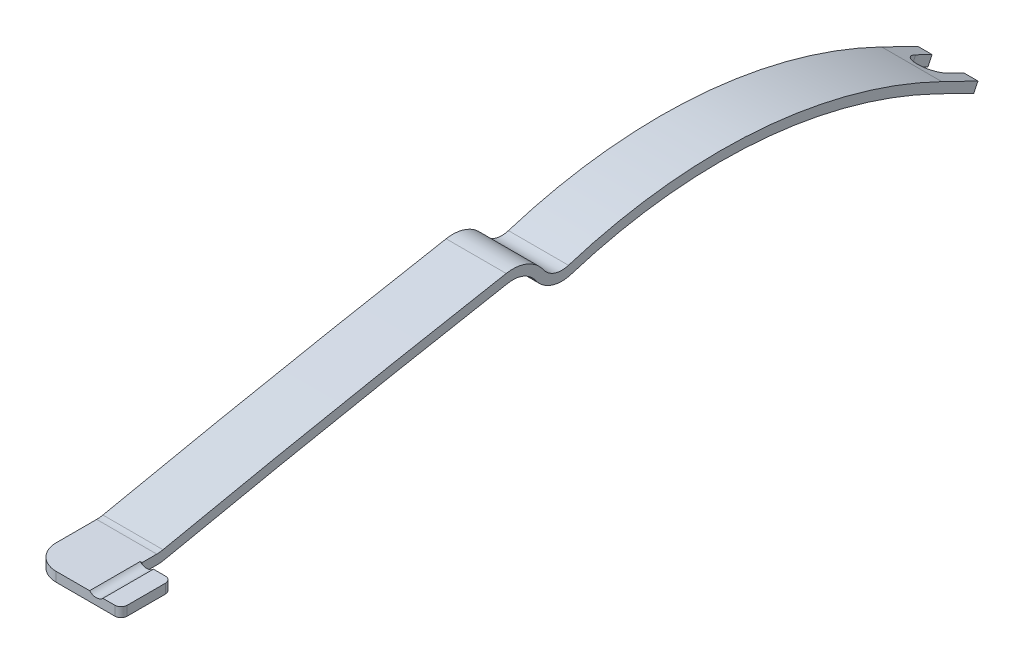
ISO-10303-21;
HEADER;
FILE_DESCRIPTION(('STEP AP214'),'2;1');
FILE_NAME('part.step','',(''),(''),'','','');
FILE_SCHEMA(('AUTOMOTIVE_DESIGN { 1 0 10303 214 1 1 1 1 }'));
ENDSEC;
DATA;
#1=APPLICATION_CONTEXT('core data for automotive mechanical design processes');
#2=APPLICATION_PROTOCOL_DEFINITION('international standard','automotive_design',2000,#1);
#3=PRODUCT_CONTEXT('',#1,'mechanical');
#4=PRODUCT('Part','Part','',(#3));
#5=PRODUCT_RELATED_PRODUCT_CATEGORY('part','',(#4));
#6=PRODUCT_DEFINITION_FORMATION('','',#4);
#7=PRODUCT_DEFINITION_CONTEXT('part definition',#1,'design');
#8=PRODUCT_DEFINITION('design','',#6,#7);
#9=PRODUCT_DEFINITION_SHAPE('','',#8);
#10=(LENGTH_UNIT() NAMED_UNIT(*) SI_UNIT(.MILLI.,.METRE.));
#11=(NAMED_UNIT(*) PLANE_ANGLE_UNIT() SI_UNIT($,.RADIAN.));
#12=(NAMED_UNIT(*) SI_UNIT($,.STERADIAN.) SOLID_ANGLE_UNIT());
#13=UNCERTAINTY_MEASURE_WITH_UNIT(LENGTH_MEASURE(1.E-05),#10,'distance_accuracy_value','');
#14=(GEOMETRIC_REPRESENTATION_CONTEXT(3) GLOBAL_UNCERTAINTY_ASSIGNED_CONTEXT((#13)) GLOBAL_UNIT_ASSIGNED_CONTEXT((#10,
#11,#12)) REPRESENTATION_CONTEXT('',''));
#15=CARTESIAN_POINT('',(0.,0.,0.));
#16=DIRECTION('',(0.,0.,1.));
#17=DIRECTION('',(1.,0.,0.));
#18=AXIS2_PLACEMENT_3D('',#15,#16,#17);
#19=CARTESIAN_POINT('',(7.6962,1.21412,53.34));
#20=DIRECTION('',(0.,-1.,0.));
#21=DIRECTION('',(0.,0.,-1.));
#22=AXIS2_PLACEMENT_3D('',#19,#20,#21);
#23=PLANE('',#22);
#24=DIRECTION('',(-1.,0.,0.));
#25=VECTOR('',#24,1.);
#26=CARTESIAN_POINT('',(7.6962,1.21412,46.863));
#27=LINE('',#26,#25);
#28=CARTESIAN_POINT('',(10.68705,1.21412,46.863));
#29=VERTEX_POINT('',#28);
#30=CARTESIAN_POINT('',(9.15451734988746,1.21412,46.863));
#31=VERTEX_POINT('',#30);
#32=EDGE_CURVE('E380',#29,#31,#27,.T.);
#33=ORIENTED_EDGE('',*,*,#32,.T.);
#34=DIRECTION('',(0.,0.,-1.));
#35=VECTOR('',#34,1.);
#36=CARTESIAN_POINT('',(9.15451734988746,1.21412,56.7075960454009));
#37=LINE('',#36,#35);
#38=CARTESIAN_POINT('',(9.15451734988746,1.21412,53.34));
#39=VERTEX_POINT('',#38);
#40=EDGE_CURVE('E52',#31,#39,#37,.F.);
#41=ORIENTED_EDGE('',*,*,#40,.T.);
#42=DIRECTION('',(-1.,0.,0.));
#43=VECTOR('',#42,1.);
#44=CARTESIAN_POINT('',(7.6962,1.21412,53.34));
#45=LINE('',#44,#43);
#46=CARTESIAN_POINT('',(10.68705,1.21412,53.34));
#47=VERTEX_POINT('',#46);
#48=EDGE_CURVE('E236',#47,#39,#45,.T.);
#49=ORIENTED_EDGE('',*,*,#48,.F.);
#50=CARTESIAN_POINT('',(10.68705,1.21412,52.54625));
#51=DIRECTION('',(0.,1.,0.));
#52=DIRECTION('',(0.,0.,1.));
#53=AXIS2_PLACEMENT_3D('',#50,#51,#52);
#54=CIRCLE('',#53,0.793750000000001);
#55=CARTESIAN_POINT('',(11.4808,1.21412,52.54625));
#56=VERTEX_POINT('',#55);
#57=EDGE_CURVE('E504',#47,#56,#54,.T.);
#58=ORIENTED_EDGE('',*,*,#57,.T.);
#59=DIRECTION('',(0.,0.,-1.));
#60=VECTOR('',#59,1.);
#61=CARTESIAN_POINT('',(11.4808,1.21412,52.54625));
#62=LINE('',#61,#60);
#63=CARTESIAN_POINT('',(11.4808,1.21412,47.65675));
#64=VERTEX_POINT('',#63);
#65=EDGE_CURVE('E506',#56,#64,#62,.T.);
#66=ORIENTED_EDGE('',*,*,#65,.T.);
#67=CARTESIAN_POINT('',(10.68705,1.21412,47.65675));
#68=DIRECTION('',(0.,1.,0.));
#69=DIRECTION('',(0.,0.,-1.));
#70=AXIS2_PLACEMENT_3D('',#67,#68,#69);
#71=CIRCLE('',#70,0.793750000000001);
#72=EDGE_CURVE('E383',#64,#29,#71,.T.);
#73=ORIENTED_EDGE('',*,*,#72,.T.);
#74=EDGE_LOOP('',(#33,#41,#49,#58,#66,#73));
#75=FACE_BOUND('',#74,.T.);
#76=ADVANCED_FACE('F35',(#75),#23,.F.);
#77=CARTESIAN_POINT('',(7.6962,0.,-59.69));
#78=DIRECTION('',(0.,0.437146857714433,0.899390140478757));
#79=DIRECTION('',(0.,-0.899390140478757,0.437146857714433));
#80=AXIS2_PLACEMENT_3D('',#77,#78,#79);
#81=PLANE('',#80);
#82=DIRECTION('',(-1.,0.,0.));
#83=VECTOR('',#82,1.);
#84=CARTESIAN_POINT('',(7.6962,1.0919675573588,-60.2207487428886));
#85=LINE('',#84,#83);
#86=CARTESIAN_POINT('',(1.8161,1.0919675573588,-60.2207487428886));
#87=VERTEX_POINT('',#86);
#88=CARTESIAN_POINT('',(0.,1.0919675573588,-60.2207487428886));
#89=VERTEX_POINT('',#88);
#90=EDGE_CURVE('E269',#87,#89,#85,.T.);
#91=ORIENTED_EDGE('',*,*,#90,.F.);
#92=DIRECTION('',(0.,0.899390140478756,-0.437146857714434));
#93=VECTOR('',#92,1.);
#94=CARTESIAN_POINT('',(1.8161,-44.4395048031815,-38.0902636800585));
#95=LINE('',#94,#93);
#96=CARTESIAN_POINT('',(1.8161,0.,-59.69));
#97=VERTEX_POINT('',#96);
#98=EDGE_CURVE('E409',#97,#87,#95,.T.);
#99=ORIENTED_EDGE('',*,*,#98,.F.);
#100=DIRECTION('',(-1.,0.,0.));
#101=VECTOR('',#100,1.);
#102=CARTESIAN_POINT('',(7.6962,0.,-59.69));
#103=LINE('',#102,#101);
#104=CARTESIAN_POINT('',(0.,0.,-59.69));
#105=VERTEX_POINT('',#104);
#106=EDGE_CURVE('E273',#97,#105,#103,.T.);
#107=ORIENTED_EDGE('',*,*,#106,.T.);
#108=DIRECTION('',(0.,0.899390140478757,-0.437146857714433));
#109=VECTOR('',#108,1.);
#110=CARTESIAN_POINT('',(0.,0.,-59.69));
#111=LINE('',#110,#109);
#112=EDGE_CURVE('E349',#105,#89,#111,.T.);
#113=ORIENTED_EDGE('',*,*,#112,.T.);
#114=EDGE_LOOP('',(#91,#99,#107,#113));
#115=FACE_BOUND('',#114,.T.);
#116=ADVANCED_FACE('F461',(#115),#81,.F.);
#117=CARTESIAN_POINT('',(7.6962,0.,53.34));
#118=DIRECTION('',(0.,0.,-1.));
#119=DIRECTION('',(-1.,0.,0.));
#120=AXIS2_PLACEMENT_3D('',#117,#118,#119);
#121=PLANE('',#120);
#122=ORIENTED_EDGE('',*,*,#48,.T.);
#123=CARTESIAN_POINT('',(8.3058,2.049145,53.34));
#124=DIRECTION('',(0.,0.,-1.));
#125=DIRECTION('',(-1.,0.,0.));
#126=AXIS2_PLACEMENT_3D('',#123,#124,#125);
#127=CIRCLE('',#126,1.190625);
#128=CARTESIAN_POINT('',(7.45708265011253,1.21412,53.34));
#129=VERTEX_POINT('',#128);
#130=EDGE_CURVE('E223',#129,#39,#127,.F.);
#131=ORIENTED_EDGE('',*,*,#130,.F.);
#132=CARTESIAN_POINT('',(3.175,1.21412,53.34));
#133=VERTEX_POINT('',#132);
#134=EDGE_CURVE('E234',#129,#133,#45,.T.);
#135=ORIENTED_EDGE('',*,*,#134,.T.);
#136=DIRECTION('',(0.,-1.,0.));
#137=VECTOR('',#136,1.);
#138=CARTESIAN_POINT('',(3.175,0.,53.34));
#139=LINE('',#138,#137);
#140=CARTESIAN_POINT('',(3.175,0.,53.34));
#141=VERTEX_POINT('',#140);
#142=EDGE_CURVE('E298',#133,#141,#139,.T.);
#143=ORIENTED_EDGE('',*,*,#142,.T.);
#144=DIRECTION('',(-1.,0.,0.));
#145=VECTOR('',#144,1.);
#146=CARTESIAN_POINT('',(7.6962,0.,53.34));
#147=LINE('',#146,#145);
#148=CARTESIAN_POINT('',(10.68705,0.,53.34));
#149=VERTEX_POINT('',#148);
#150=EDGE_CURVE('E295',#149,#141,#147,.T.);
#151=ORIENTED_EDGE('',*,*,#150,.F.);
#152=DIRECTION('',(0.,1.,0.));
#153=VECTOR('',#152,1.);
#154=CARTESIAN_POINT('',(10.68705,-7.50164822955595,53.34));
#155=LINE('',#154,#153);
#156=EDGE_CURVE('E382',#149,#47,#155,.T.);
#157=ORIENTED_EDGE('',*,*,#156,.T.);
#158=EDGE_LOOP('',(#122,#131,#135,#143,#151,#157));
#159=FACE_BOUND('',#158,.T.);
#160=ADVANCED_FACE('F232',(#159),#121,.F.);
#161=CARTESIAN_POINT('',(7.6962,0.,53.34));
#162=DIRECTION('',(0.,1.,0.));
#163=DIRECTION('',(0.,0.,1.));
#164=AXIS2_PLACEMENT_3D('',#161,#162,#163);
#165=PLANE('',#164);
#166=ORIENTED_EDGE('',*,*,#150,.T.);
#167=CARTESIAN_POINT('',(3.175,0.,50.165));
#168=DIRECTION('',(0.,1.,0.));
#169=DIRECTION('',(0.,0.,1.));
#170=AXIS2_PLACEMENT_3D('',#167,#168,#169);
#171=CIRCLE('',#170,3.175);
#172=CARTESIAN_POINT('',(0.,0.,50.165));
#173=VERTEX_POINT('',#172);
#174=EDGE_CURVE('E367',#141,#173,#171,.F.);
#175=ORIENTED_EDGE('',*,*,#174,.T.);
#176=DIRECTION('',(0.,0.,-1.));
#177=VECTOR('',#176,1.);
#178=CARTESIAN_POINT('',(0.,0.,53.34));
#179=LINE('',#178,#177);
#180=CARTESIAN_POINT('',(0.,0.,44.984535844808));
#181=VERTEX_POINT('',#180);
#182=EDGE_CURVE('E334',#173,#181,#179,.T.);
#183=ORIENTED_EDGE('',*,*,#182,.T.);
#184=DIRECTION('',(-1.,0.,0.));
#185=VECTOR('',#184,1.);
#186=CARTESIAN_POINT('',(7.6962,0.,44.984535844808));
#187=LINE('',#186,#185);
#188=CARTESIAN_POINT('',(7.6962,0.,44.984535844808));
#189=VERTEX_POINT('',#188);
#190=EDGE_CURVE('E292',#189,#181,#187,.T.);
#191=ORIENTED_EDGE('',*,*,#190,.F.);
#192=DIRECTION('',(0.,0.,-1.));
#193=VECTOR('',#192,1.);
#194=CARTESIAN_POINT('',(7.6962,0.,53.34));
#195=LINE('',#194,#193);
#196=CARTESIAN_POINT('',(7.6962,0.,46.863));
#197=VERTEX_POINT('',#196);
#198=EDGE_CURVE('E299',#197,#189,#195,.T.);
#199=ORIENTED_EDGE('',*,*,#198,.F.);
#200=DIRECTION('',(1.,0.,0.));
#201=VECTOR('',#200,1.);
#202=CARTESIAN_POINT('',(7.6962,0.,46.863));
#203=LINE('',#202,#201);
#204=CARTESIAN_POINT('',(10.68705,0.,46.863));
#205=VERTEX_POINT('',#204);
#206=EDGE_CURVE('E374',#197,#205,#203,.T.);
#207=ORIENTED_EDGE('',*,*,#206,.T.);
#208=CARTESIAN_POINT('',(10.68705,0.,47.65675));
#209=DIRECTION('',(0.,1.,0.));
#210=DIRECTION('',(0.,0.,1.));
#211=AXIS2_PLACEMENT_3D('',#208,#209,#210);
#212=CIRCLE('',#211,0.793750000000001);
#213=CARTESIAN_POINT('',(11.4808,0.,47.65675));
#214=VERTEX_POINT('',#213);
#215=EDGE_CURVE('E377',#205,#214,#212,.F.);
#216=ORIENTED_EDGE('',*,*,#215,.T.);
#217=DIRECTION('',(0.,0.,1.));
#218=VECTOR('',#217,1.);
#219=CARTESIAN_POINT('',(11.4808,0.,52.54625));
#220=LINE('',#219,#218);
#221=CARTESIAN_POINT('',(11.4808,0.,52.54625));
#222=VERTEX_POINT('',#221);
#223=EDGE_CURVE('E499',#214,#222,#220,.T.);
#224=ORIENTED_EDGE('',*,*,#223,.T.);
#225=CARTESIAN_POINT('',(10.68705,0.,52.54625));
#226=DIRECTION('',(0.,1.,0.));
#227=DIRECTION('',(0.,0.,1.));
#228=AXIS2_PLACEMENT_3D('',#225,#226,#227);
#229=CIRCLE('',#228,0.793750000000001);
#230=EDGE_CURVE('E386',#222,#149,#229,.F.);
#231=ORIENTED_EDGE('',*,*,#230,.T.);
#232=EDGE_LOOP('',(#166,#175,#183,#191,#199,#207,#216,#224,#231));
#233=FACE_BOUND('',#232,.T.);
#234=ADVANCED_FACE('F491',(#233),#165,.F.);
#235=CARTESIAN_POINT('',(7.6962,5.07999999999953,44.984535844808));
#236=DIRECTION('',(-1.,0.,0.));
#237=DIRECTION('',(0.,0.,1.));
#238=AXIS2_PLACEMENT_3D('',#235,#236,#237);
#239=CYLINDRICAL_SURFACE('',#238,5.0799999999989);
#240=CARTESIAN_POINT('',(0.,5.07999999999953,44.984535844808));
#241=DIRECTION('',(1.,0.,0.));
#242=DIRECTION('',(0.,0.,-1.));
#243=AXIS2_PLACEMENT_3D('',#240,#241,#242);
#244=CIRCLE('',#243,5.0799999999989);
#245=CARTESIAN_POINT('',(0.,0.111072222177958,43.9280526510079));
#246=VERTEX_POINT('',#245);
#247=EDGE_CURVE('E336',#181,#246,#244,.T.);
#248=ORIENTED_EDGE('',*,*,#247,.T.);
#249=DIRECTION('',(-1.,0.,0.));
#250=VECTOR('',#249,1.);
#251=CARTESIAN_POINT('',(7.6962,0.111072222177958,43.9280526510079));
#252=LINE('',#251,#250);
#253=CARTESIAN_POINT('',(7.6962,0.111072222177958,43.9280526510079));
#254=VERTEX_POINT('',#253);
#255=EDGE_CURVE('E289',#254,#246,#252,.T.);
#256=ORIENTED_EDGE('',*,*,#255,.F.);
#257=CARTESIAN_POINT('',(7.6962,5.07999999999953,44.984535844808));
#258=DIRECTION('',(1.,0.,0.));
#259=DIRECTION('',(0.,0.,-1.));
#260=AXIS2_PLACEMENT_3D('',#257,#258,#259);
#261=CIRCLE('',#260,5.0799999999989);
#262=EDGE_CURVE('E301',#189,#254,#261,.T.);
#263=ORIENTED_EDGE('',*,*,#262,.F.);
#264=ORIENTED_EDGE('',*,*,#190,.T.);
#265=EDGE_LOOP('',(#248,#256,#263,#264));
#266=FACE_BOUND('',#265,.T.);
#267=ADVANCED_FACE('F576',(#266),#239,.T.);
#268=CARTESIAN_POINT('',(7.6962,-1470.00667961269,-268.645356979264));
#269=DIRECTION('',(-1.,0.,0.));
#270=DIRECTION('',(0.,0.,1.));
#271=AXIS2_PLACEMENT_3D('',#268,#269,#270);
#272=CYLINDRICAL_SURFACE('',#271,1502.979820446);
#273=CARTESIAN_POINT('',(0.,-1470.00667961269,-268.645356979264));
#274=DIRECTION('',(-1.,0.,0.));
#275=DIRECTION('',(0.,0.,1.));
#276=AXIS2_PLACEMENT_3D('',#273,#274,#275);
#277=CIRCLE('',#276,1502.979820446);
#278=CARTESIAN_POINT('',(0.,8.7691698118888,0.));
#279=VERTEX_POINT('',#278);
#280=EDGE_CURVE('E338',#246,#279,#277,.T.);
#281=ORIENTED_EDGE('',*,*,#280,.T.);
#282=DIRECTION('',(-1.,0.,0.));
#283=VECTOR('',#282,1.);
#284=CARTESIAN_POINT('',(7.6962,8.7691698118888,0.));
#285=LINE('',#284,#283);
#286=CARTESIAN_POINT('',(7.6962,8.7691698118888,0.));
#287=VERTEX_POINT('',#286);
#288=EDGE_CURVE('E286',#287,#279,#285,.T.);
#289=ORIENTED_EDGE('',*,*,#288,.F.);
#290=CARTESIAN_POINT('',(7.6962,-1470.00667961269,-268.645356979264));
#291=DIRECTION('',(-1.,0.,0.));
#292=DIRECTION('',(0.,0.,1.));
#293=AXIS2_PLACEMENT_3D('',#290,#291,#292);
#294=CIRCLE('',#293,1502.979820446);
#295=EDGE_CURVE('E310',#254,#287,#294,.T.);
#296=ORIENTED_EDGE('',*,*,#295,.F.);
#297=ORIENTED_EDGE('',*,*,#255,.T.);
#298=EDGE_LOOP('',(#281,#289,#296,#297));
#299=FACE_BOUND('',#298,.T.);
#300=ADVANCED_FACE('F572',(#299),#272,.F.);
#301=CARTESIAN_POINT('',(7.6962,5.27043559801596,-0.635605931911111));
#302=DIRECTION('',(-1.,0.,0.));
#303=DIRECTION('',(0.,0.,1.));
#304=AXIS2_PLACEMENT_3D('',#301,#302,#303);
#305=CYLINDRICAL_SURFACE('',#304,3.556);
#306=CARTESIAN_POINT('',(0.,5.27043559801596,-0.635605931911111));
#307=DIRECTION('',(-1.,0.,0.));
#308=DIRECTION('',(0.,0.,1.));
#309=AXIS2_PLACEMENT_3D('',#306,#307,#308);
#310=CIRCLE('',#309,3.556);
#311=CARTESIAN_POINT('',(0.,7.2898,-3.56260156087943));
#312=VERTEX_POINT('',#311);
#313=EDGE_CURVE('E340',#279,#312,#310,.T.);
#314=ORIENTED_EDGE('',*,*,#313,.T.);
#315=DIRECTION('',(-1.,0.,0.));
#316=VECTOR('',#315,1.);
#317=CARTESIAN_POINT('',(7.6962,7.2898,-3.56260156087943));
#318=LINE('',#317,#316);
#319=CARTESIAN_POINT('',(7.6962,7.2898,-3.56260156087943));
#320=VERTEX_POINT('',#319);
#321=EDGE_CURVE('E283',#320,#312,#318,.T.);
#322=ORIENTED_EDGE('',*,*,#321,.F.);
#323=CARTESIAN_POINT('',(7.6962,5.27043559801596,-0.635605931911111));
#324=DIRECTION('',(-1.,0.,0.));
#325=DIRECTION('',(0.,0.,1.));
#326=AXIS2_PLACEMENT_3D('',#323,#324,#325);
#327=CIRCLE('',#326,3.556);
#328=EDGE_CURVE('E312',#287,#320,#327,.T.);
#329=ORIENTED_EDGE('',*,*,#328,.F.);
#330=ORIENTED_EDGE('',*,*,#288,.T.);
#331=EDGE_LOOP('',(#314,#322,#329,#330));
#332=FACE_BOUND('',#331,.T.);
#333=ADVANCED_FACE('F568',(#332),#305,.F.);
#334=CARTESIAN_POINT('',(7.6962,9.5976450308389,-6.9077394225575));
#335=DIRECTION('',(-1.,0.,0.));
#336=DIRECTION('',(0.,0.,1.));
#337=AXIS2_PLACEMENT_3D('',#334,#335,#336);
#338=CYLINDRICAL_SURFACE('',#337,4.06400000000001);
#339=CARTESIAN_POINT('',(0.,9.5976450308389,-6.9077394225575));
#340=DIRECTION('',(1.,0.,0.));
#341=DIRECTION('',(0.,0.,-1.));
#342=AXIS2_PLACEMENT_3D('',#339,#340,#341);
#343=CIRCLE('',#342,4.06400000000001);
#344=CARTESIAN_POINT('',(0.,5.72116981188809,-8.128));
#345=VERTEX_POINT('',#344);
#346=EDGE_CURVE('E342',#312,#345,#343,.T.);
#347=ORIENTED_EDGE('',*,*,#346,.T.);
#348=DIRECTION('',(-1.,0.,0.));
#349=VECTOR('',#348,1.);
#350=CARTESIAN_POINT('',(7.6962,5.72116981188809,-8.128));
#351=LINE('',#350,#349);
#352=CARTESIAN_POINT('',(7.6962,5.72116981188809,-8.128));
#353=VERTEX_POINT('',#352);
#354=EDGE_CURVE('E280',#353,#345,#351,.T.);
#355=ORIENTED_EDGE('',*,*,#354,.F.);
#356=CARTESIAN_POINT('',(7.6962,9.5976450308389,-6.9077394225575));
#357=DIRECTION('',(1.,0.,0.));
#358=DIRECTION('',(0.,0.,-1.));
#359=AXIS2_PLACEMENT_3D('',#356,#357,#358);
#360=CIRCLE('',#359,4.06400000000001);
#361=EDGE_CURVE('E314',#320,#353,#360,.T.);
#362=ORIENTED_EDGE('',*,*,#361,.F.);
#363=ORIENTED_EDGE('',*,*,#321,.T.);
#364=EDGE_LOOP('',(#347,#355,#362,#363));
#365=FACE_BOUND('',#364,.T.);
#366=ADVANCED_FACE('F565',(#365),#338,.T.);
#367=CARTESIAN_POINT('',(7.6962,-54.9733376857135,-27.2337882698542));
#368=DIRECTION('',(-1.,0.,0.));
#369=DIRECTION('',(0.,0.,1.));
#370=AXIS2_PLACEMENT_3D('',#367,#368,#369);
#371=CYLINDRICAL_SURFACE('',#370,63.6306088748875);
#372=CARTESIAN_POINT('',(0.,-54.9733376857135,-27.2337882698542));
#373=DIRECTION('',(-1.,0.,0.));
#374=DIRECTION('',(0.,0.,1.));
#375=AXIS2_PLACEMENT_3D('',#372,#373,#374);
#376=CIRCLE('',#375,63.6306088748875);
#377=CARTESIAN_POINT('',(0.,2.2554045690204,-55.0497089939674));
#378=VERTEX_POINT('',#377);
#379=EDGE_CURVE('E344',#345,#378,#376,.T.);
#380=ORIENTED_EDGE('',*,*,#379,.T.);
#381=DIRECTION('',(-1.,0.,0.));
#382=VECTOR('',#381,1.);
#383=CARTESIAN_POINT('',(7.6962,2.2554045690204,-55.0497089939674));
#384=LINE('',#383,#382);
#385=CARTESIAN_POINT('',(7.6962,2.2554045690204,-55.0497089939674));
#386=VERTEX_POINT('',#385);
#387=EDGE_CURVE('E277',#386,#378,#384,.T.);
#388=ORIENTED_EDGE('',*,*,#387,.F.);
#389=CARTESIAN_POINT('',(7.6962,-54.9733376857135,-27.2337882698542));
#390=DIRECTION('',(-1.,0.,0.));
#391=DIRECTION('',(0.,0.,1.));
#392=AXIS2_PLACEMENT_3D('',#389,#390,#391);
#393=CIRCLE('',#392,63.6306088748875);
#394=EDGE_CURVE('E316',#353,#386,#393,.T.);
#395=ORIENTED_EDGE('',*,*,#394,.F.);
#396=ORIENTED_EDGE('',*,*,#354,.T.);
#397=EDGE_LOOP('',(#380,#388,#395,#396));
#398=FACE_BOUND('',#397,.T.);
#399=ADVANCED_FACE('F562',(#398),#371,.F.);
#400=CARTESIAN_POINT('',(7.6962,2.25540456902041,-55.0497089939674));
#401=DIRECTION('',(0.,0.899390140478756,-0.437146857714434));
#402=DIRECTION('',(0.,0.437146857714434,0.899390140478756));
#403=AXIS2_PLACEMENT_3D('',#400,#401,#402);
#404=PLANE('',#403);
#405=ORIENTED_EDGE('',*,*,#106,.F.);
#406=DIRECTION('',(0.,0.437146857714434,0.899390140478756));
#407=VECTOR('',#406,1.);
#408=CARTESIAN_POINT('',(1.8161,2.25540456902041,-55.0497089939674));
#409=LINE('',#408,#407);
#410=CARTESIAN_POINT('',(1.8161,1.02013683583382,-57.5911606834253));
#411=VERTEX_POINT('',#410);
#412=EDGE_CURVE('E417',#97,#411,#409,.T.);
#413=ORIENTED_EDGE('',*,*,#412,.T.);
#414=CARTESIAN_POINT('',(3.8481,1.02013683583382,-57.5911606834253));
#415=DIRECTION('',(0.,0.899390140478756,-0.437146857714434));
#416=DIRECTION('',(0.,0.437146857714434,0.899390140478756));
#417=AXIS2_PLACEMENT_3D('',#414,#415,#416);
#418=CIRCLE('',#417,2.032);
#419=CARTESIAN_POINT('',(5.8801,1.02013683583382,-57.5911606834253));
#420=VERTEX_POINT('',#419);
#421=EDGE_CURVE('E307',#411,#420,#418,.T.);
#422=ORIENTED_EDGE('',*,*,#421,.T.);
#423=DIRECTION('',(0.,-0.437146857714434,-0.899390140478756));
#424=VECTOR('',#423,1.);
#425=CARTESIAN_POINT('',(5.8801,2.25540456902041,-55.0497089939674));
#426=LINE('',#425,#424);
#427=CARTESIAN_POINT('',(5.8801,0.,-59.69));
#428=VERTEX_POINT('',#427);
#429=EDGE_CURVE('E408',#420,#428,#426,.T.);
#430=ORIENTED_EDGE('',*,*,#429,.T.);
#431=CARTESIAN_POINT('',(7.6962,0.,-59.69));
#432=VERTEX_POINT('',#431);
#433=EDGE_CURVE('E274',#432,#428,#103,.T.);
#434=ORIENTED_EDGE('',*,*,#433,.F.);
#435=DIRECTION('',(0.,-0.437146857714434,-0.899390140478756));
#436=VECTOR('',#435,1.);
#437=CARTESIAN_POINT('',(7.6962,2.25540456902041,-55.0497089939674));
#438=LINE('',#437,#436);
#439=EDGE_CURVE('E318',#386,#432,#438,.T.);
#440=ORIENTED_EDGE('',*,*,#439,.F.);
#441=ORIENTED_EDGE('',*,*,#387,.T.);
#442=DIRECTION('',(0.,-0.437146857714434,-0.899390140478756));
#443=VECTOR('',#442,1.);
#444=CARTESIAN_POINT('',(0.,2.25540456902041,-55.0497089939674));
#445=LINE('',#444,#443);
#446=EDGE_CURVE('E346',#378,#105,#445,.T.);
#447=ORIENTED_EDGE('',*,*,#446,.T.);
#448=EDGE_LOOP('',(#405,#413,#422,#430,#434,#440,#441,#447));
#449=FACE_BOUND('',#448,.T.);
#450=ADVANCED_FACE('F422',(#449),#404,.F.);
#451=ORIENTED_EDGE('',*,*,#433,.T.);
#452=DIRECTION('',(0.,0.899390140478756,-0.437146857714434));
#453=VECTOR('',#452,1.);
#454=CARTESIAN_POINT('',(5.8801,-44.4395048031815,-38.0902636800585));
#455=LINE('',#454,#453);
#456=CARTESIAN_POINT('',(5.8801,1.0919675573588,-60.2207487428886));
#457=VERTEX_POINT('',#456);
#458=EDGE_CURVE('E411',#428,#457,#455,.T.);
#459=ORIENTED_EDGE('',*,*,#458,.T.);
#460=CARTESIAN_POINT('',(7.6962,1.0919675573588,-60.2207487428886));
#461=VERTEX_POINT('',#460);
#462=EDGE_CURVE('E270',#461,#457,#85,.T.);
#463=ORIENTED_EDGE('',*,*,#462,.F.);
#464=DIRECTION('',(0.,0.899390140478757,-0.437146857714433));
#465=VECTOR('',#464,1.);
#466=CARTESIAN_POINT('',(7.6962,0.,-59.69));
#467=LINE('',#466,#465);
#468=EDGE_CURVE('E320',#432,#461,#467,.T.);
#469=ORIENTED_EDGE('',*,*,#468,.F.);
#470=EDGE_LOOP('',(#451,#459,#463,#469));
#471=FACE_BOUND('',#470,.T.);
#472=ADVANCED_FACE('F441',(#471),#81,.F.);
#473=CARTESIAN_POINT('',(7.6962,1.0919675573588,-60.2207487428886));
#474=DIRECTION('',(0.,-0.899390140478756,0.437146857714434));
#475=DIRECTION('',(0.,-0.437146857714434,-0.899390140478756));
#476=AXIS2_PLACEMENT_3D('',#473,#474,#475);
#477=PLANE('',#476);
#478=CARTESIAN_POINT('',(3.8481,2.11210439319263,-58.1219094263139));
#479=DIRECTION('',(0.,0.899390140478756,-0.437146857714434));
#480=DIRECTION('',(0.,-0.437146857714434,-0.899390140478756));
#481=AXIS2_PLACEMENT_3D('',#478,#479,#480);
#482=CIRCLE('',#481,2.032);
#483=CARTESIAN_POINT('',(1.8161,2.11210439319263,-58.1219094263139));
#484=VERTEX_POINT('',#483);
#485=CARTESIAN_POINT('',(5.8801,2.11210439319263,-58.1219094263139));
#486=VERTEX_POINT('',#485);
#487=EDGE_CURVE('E376',#484,#486,#482,.T.);
#488=ORIENTED_EDGE('',*,*,#487,.F.);
#489=DIRECTION('',(0.,0.437146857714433,0.899390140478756));
#490=VECTOR('',#489,1.);
#491=CARTESIAN_POINT('',(1.8161,2.11210439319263,-58.1219094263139));
#492=LINE('',#491,#490);
#493=EDGE_CURVE('E402',#87,#484,#492,.T.);
#494=ORIENTED_EDGE('',*,*,#493,.F.);
#495=ORIENTED_EDGE('',*,*,#90,.T.);
#496=DIRECTION('',(0.,0.437146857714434,0.899390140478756));
#497=VECTOR('',#496,1.);
#498=CARTESIAN_POINT('',(0.,1.0919675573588,-60.2207487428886));
#499=LINE('',#498,#497);
#500=CARTESIAN_POINT('',(0.,3.34737212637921,-55.580457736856));
#501=VERTEX_POINT('',#500);
#502=EDGE_CURVE('E352',#89,#501,#499,.T.);
#503=ORIENTED_EDGE('',*,*,#502,.T.);
#504=DIRECTION('',(-1.,0.,0.));
#505=VECTOR('',#504,1.);
#506=CARTESIAN_POINT('',(7.6962,3.34737212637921,-55.580457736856));
#507=LINE('',#506,#505);
#508=CARTESIAN_POINT('',(7.6962,3.34737212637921,-55.580457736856));
#509=VERTEX_POINT('',#508);
#510=EDGE_CURVE('E266',#509,#501,#507,.T.);
#511=ORIENTED_EDGE('',*,*,#510,.F.);
#512=DIRECTION('',(0.,0.437146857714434,0.899390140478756));
#513=VECTOR('',#512,1.);
#514=CARTESIAN_POINT('',(7.6962,1.0919675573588,-60.2207487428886));
#515=LINE('',#514,#513);
#516=EDGE_CURVE('E322',#461,#509,#515,.T.);
#517=ORIENTED_EDGE('',*,*,#516,.F.);
#518=ORIENTED_EDGE('',*,*,#462,.T.);
#519=DIRECTION('',(0.,-0.437146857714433,-0.899390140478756));
#520=VECTOR('',#519,1.);
#521=CARTESIAN_POINT('',(5.8801,1.0919675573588,-60.2207487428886));
#522=LINE('',#521,#520);
#523=EDGE_CURVE('E400',#486,#457,#522,.T.);
#524=ORIENTED_EDGE('',*,*,#523,.F.);
#525=EDGE_LOOP('',(#488,#494,#495,#503,#511,#517,#518,#524));
#526=FACE_BOUND('',#525,.T.);
#527=ADVANCED_FACE('F436',(#526),#477,.F.);
#528=CARTESIAN_POINT('',(7.6962,-54.9733376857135,-27.2337882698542));
#529=DIRECTION('',(-1.,0.,0.));
#530=DIRECTION('',(0.,0.,1.));
#531=AXIS2_PLACEMENT_3D('',#528,#529,#530);
#532=CYLINDRICAL_SURFACE('',#531,64.8447288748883);
#533=CARTESIAN_POINT('',(0.,-54.9733376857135,-27.2337882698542));
#534=DIRECTION('',(1.,0.,0.));
#535=DIRECTION('',(0.,0.,1.));
#536=AXIS2_PLACEMENT_3D('',#533,#534,#535);
#537=CIRCLE('',#536,64.8447288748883);
#538=CARTESIAN_POINT('',(0.,6.87926678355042,-7.7634471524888));
#539=VERTEX_POINT('',#538);
#540=EDGE_CURVE('E354',#501,#539,#537,.T.);
#541=ORIENTED_EDGE('',*,*,#540,.T.);
#542=DIRECTION('',(-1.,0.,0.));
#543=VECTOR('',#542,1.);
#544=CARTESIAN_POINT('',(7.6962,6.87926678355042,-7.7634471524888));
#545=LINE('',#544,#543);
#546=CARTESIAN_POINT('',(7.6962,6.87926678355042,-7.7634471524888));
#547=VERTEX_POINT('',#546);
#548=EDGE_CURVE('E263',#547,#539,#545,.T.);
#549=ORIENTED_EDGE('',*,*,#548,.F.);
#550=CARTESIAN_POINT('',(7.6962,-54.9733376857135,-27.2337882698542));
#551=DIRECTION('',(1.,0.,0.));
#552=DIRECTION('',(0.,0.,1.));
#553=AXIS2_PLACEMENT_3D('',#550,#551,#552);
#554=CIRCLE('',#553,64.8447288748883);
#555=EDGE_CURVE('E324',#509,#547,#554,.T.);
#556=ORIENTED_EDGE('',*,*,#555,.F.);
#557=ORIENTED_EDGE('',*,*,#510,.T.);
#558=EDGE_LOOP('',(#541,#549,#556,#557));
#559=FACE_BOUND('',#558,.T.);
#560=ADVANCED_FACE('F463',(#559),#532,.T.);
#561=CARTESIAN_POINT('',(7.6962,9.5976450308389,-6.9077394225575));
#562=DIRECTION('',(-1.,0.,0.));
#563=DIRECTION('',(0.,0.,1.));
#564=AXIS2_PLACEMENT_3D('',#561,#562,#563);
#565=CYLINDRICAL_SURFACE('',#564,2.84987999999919);
#566=CARTESIAN_POINT('',(0.,9.5976450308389,-6.9077394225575));
#567=DIRECTION('',(-1.,0.,0.));
#568=DIRECTION('',(0.,0.,-1.));
#569=AXIS2_PLACEMENT_3D('',#566,#567,#568);
#570=CIRCLE('',#569,2.84987999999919);
#571=CARTESIAN_POINT('',(0.,7.97926870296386,-4.56196149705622));
#572=VERTEX_POINT('',#571);
#573=EDGE_CURVE('E356',#539,#572,#570,.T.);
#574=ORIENTED_EDGE('',*,*,#573,.T.);
#575=DIRECTION('',(-1.,0.,0.));
#576=VECTOR('',#575,1.);
#577=CARTESIAN_POINT('',(7.6962,7.97926870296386,-4.56196149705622));
#578=LINE('',#577,#576);
#579=CARTESIAN_POINT('',(7.6962,7.97926870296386,-4.56196149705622));
#580=VERTEX_POINT('',#579);
#581=EDGE_CURVE('E260',#580,#572,#578,.T.);
#582=ORIENTED_EDGE('',*,*,#581,.F.);
#583=CARTESIAN_POINT('',(7.6962,9.5976450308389,-6.9077394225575));
#584=DIRECTION('',(-1.,0.,0.));
#585=DIRECTION('',(0.,0.,-1.));
#586=AXIS2_PLACEMENT_3D('',#583,#584,#585);
#587=CIRCLE('',#586,2.84987999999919);
#588=EDGE_CURVE('E326',#547,#580,#587,.T.);
#589=ORIENTED_EDGE('',*,*,#588,.F.);
#590=ORIENTED_EDGE('',*,*,#548,.T.);
#591=EDGE_LOOP('',(#574,#582,#589,#590));
#592=FACE_BOUND('',#591,.T.);
#593=ADVANCED_FACE('F469',(#592),#565,.F.);
#594=CARTESIAN_POINT('',(7.6962,5.27043559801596,-0.635605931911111));
#595=DIRECTION('',(-1.,0.,0.));
#596=DIRECTION('',(0.,0.,1.));
#597=AXIS2_PLACEMENT_3D('',#594,#595,#596);
#598=CYLINDRICAL_SURFACE('',#597,4.77012000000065);
#599=CARTESIAN_POINT('',(0.,5.27043559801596,-0.635605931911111));
#600=DIRECTION('',(1.,0.,0.));
#601=DIRECTION('',(0.,0.,1.));
#602=AXIS2_PLACEMENT_3D('',#599,#600,#601);
#603=CIRCLE('',#602,4.77012000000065);
#604=CARTESIAN_POINT('',(0.,9.96373763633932,0.217014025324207));
#605=VERTEX_POINT('',#604);
#606=EDGE_CURVE('E358',#572,#605,#603,.T.);
#607=ORIENTED_EDGE('',*,*,#606,.T.);
#608=DIRECTION('',(-1.,0.,0.));
#609=VECTOR('',#608,1.);
#610=CARTESIAN_POINT('',(7.6962,9.96373763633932,0.217014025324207));
#611=LINE('',#610,#609);
#612=CARTESIAN_POINT('',(7.6962,9.96373763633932,0.217014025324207));
#613=VERTEX_POINT('',#612);
#614=EDGE_CURVE('E257',#613,#605,#611,.T.);
#615=ORIENTED_EDGE('',*,*,#614,.F.);
#616=CARTESIAN_POINT('',(7.6962,5.27043559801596,-0.635605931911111));
#617=DIRECTION('',(1.,0.,0.));
#618=DIRECTION('',(0.,0.,1.));
#619=AXIS2_PLACEMENT_3D('',#616,#617,#618);
#620=CIRCLE('',#619,4.77012000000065);
#621=EDGE_CURVE('E328',#580,#613,#620,.T.);
#622=ORIENTED_EDGE('',*,*,#621,.F.);
#623=ORIENTED_EDGE('',*,*,#581,.T.);
#624=EDGE_LOOP('',(#607,#615,#622,#623));
#625=FACE_BOUND('',#624,.T.);
#626=ADVANCED_FACE('F473',(#625),#598,.T.);
#627=CARTESIAN_POINT('',(7.6962,-1470.00667961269,-268.645356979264));
#628=DIRECTION('',(-1.,0.,0.));
#629=DIRECTION('',(0.,0.,1.));
#630=AXIS2_PLACEMENT_3D('',#627,#628,#629);
#631=CYLINDRICAL_SURFACE('',#630,1504.193940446);
#632=CARTESIAN_POINT('',(0.,-1470.00667961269,-268.645356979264));
#633=DIRECTION('',(1.,0.,0.));
#634=DIRECTION('',(0.,0.,-1.));
#635=AXIS2_PLACEMENT_3D('',#632,#633,#634);
#636=CIRCLE('',#635,1504.193940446);
#637=CARTESIAN_POINT('',(0.,1.29864596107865,44.1805521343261));
#638=VERTEX_POINT('',#637);
#639=EDGE_CURVE('E360',#605,#638,#636,.T.);
#640=ORIENTED_EDGE('',*,*,#639,.T.);
#641=DIRECTION('',(-1.,0.,0.));
#642=VECTOR('',#641,1.);
#643=CARTESIAN_POINT('',(7.6962,1.29864596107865,44.1805521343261));
#644=LINE('',#643,#642);
#645=CARTESIAN_POINT('',(7.6962,1.29864596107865,44.1805521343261));
#646=VERTEX_POINT('',#645);
#647=EDGE_CURVE('E254',#646,#638,#644,.T.);
#648=ORIENTED_EDGE('',*,*,#647,.F.);
#649=CARTESIAN_POINT('',(7.6962,-1470.00667961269,-268.645356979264));
#650=DIRECTION('',(1.,0.,0.));
#651=DIRECTION('',(0.,0.,-1.));
#652=AXIS2_PLACEMENT_3D('',#649,#650,#651);
#653=CIRCLE('',#652,1504.193940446);
#654=EDGE_CURVE('E330',#613,#646,#653,.T.);
#655=ORIENTED_EDGE('',*,*,#654,.F.);
#656=ORIENTED_EDGE('',*,*,#614,.T.);
#657=EDGE_LOOP('',(#640,#648,#655,#656));
#658=FACE_BOUND('',#657,.T.);
#659=ADVANCED_FACE('F479',(#658),#631,.T.);
#660=CARTESIAN_POINT('',(7.6962,5.07999999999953,44.984535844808));
#661=DIRECTION('',(-1.,0.,0.));
#662=DIRECTION('',(0.,0.,1.));
#663=AXIS2_PLACEMENT_3D('',#660,#661,#662);
#664=CYLINDRICAL_SURFACE('',#663,3.86587999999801);
#665=CARTESIAN_POINT('',(0.,5.07999999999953,44.984535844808));
#666=DIRECTION('',(-1.,0.,0.));
#667=DIRECTION('',(0.,0.,-1.));
#668=AXIS2_PLACEMENT_3D('',#665,#666,#667);
#669=CIRCLE('',#668,3.86587999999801);
#670=CARTESIAN_POINT('',(0.,1.21412000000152,44.984535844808));
#671=VERTEX_POINT('',#670);
#672=EDGE_CURVE('E361',#638,#671,#669,.T.);
#673=ORIENTED_EDGE('',*,*,#672,.T.);
#674=DIRECTION('',(-1.,0.,0.));
#675=VECTOR('',#674,1.);
#676=CARTESIAN_POINT('',(7.6962,1.21412000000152,44.984535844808));
#677=LINE('',#676,#675);
#678=CARTESIAN_POINT('',(7.6962,1.21412000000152,44.984535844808));
#679=VERTEX_POINT('',#678);
#680=EDGE_CURVE('E244',#679,#671,#677,.T.);
#681=ORIENTED_EDGE('',*,*,#680,.F.);
#682=CARTESIAN_POINT('',(7.6962,5.07999999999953,44.984535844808));
#683=DIRECTION('',(-1.,0.,0.));
#684=DIRECTION('',(0.,0.,-1.));
#685=AXIS2_PLACEMENT_3D('',#682,#683,#684);
#686=CIRCLE('',#685,3.86587999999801);
#687=EDGE_CURVE('E246',#646,#679,#686,.T.);
#688=ORIENTED_EDGE('',*,*,#687,.F.);
#689=ORIENTED_EDGE('',*,*,#647,.T.);
#690=EDGE_LOOP('',(#673,#681,#688,#689));
#691=FACE_BOUND('',#690,.T.);
#692=ADVANCED_FACE('F480',(#691),#664,.F.);
#693=ORIENTED_EDGE('',*,*,#134,.F.);
#694=DIRECTION('',(0.,0.,-1.));
#695=VECTOR('',#694,1.);
#696=CARTESIAN_POINT('',(7.45708265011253,1.21412,56.7075960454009));
#697=LINE('',#696,#695);
#698=CARTESIAN_POINT('',(7.45708265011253,1.21412,46.863));
#699=VERTEX_POINT('',#698);
#700=EDGE_CURVE('E220',#129,#699,#697,.T.);
#701=ORIENTED_EDGE('',*,*,#700,.T.);
#702=DIRECTION('',(1.,0.,0.));
#703=VECTOR('',#702,1.);
#704=CARTESIAN_POINT('',(7.6962,1.21412,46.863));
#705=LINE('',#704,#703);
#706=CARTESIAN_POINT('',(7.6962,1.21412,46.863));
#707=VERTEX_POINT('',#706);
#708=EDGE_CURVE('E228',#699,#707,#705,.T.);
#709=ORIENTED_EDGE('',*,*,#708,.T.);
#710=DIRECTION('',(0.,0.,1.));
#711=VECTOR('',#710,1.);
#712=CARTESIAN_POINT('',(7.6962,1.21412,53.34));
#713=LINE('',#712,#711);
#714=EDGE_CURVE('E242',#679,#707,#713,.T.);
#715=ORIENTED_EDGE('',*,*,#714,.F.);
#716=ORIENTED_EDGE('',*,*,#680,.T.);
#717=DIRECTION('',(0.,0.,1.));
#718=VECTOR('',#717,1.);
#719=CARTESIAN_POINT('',(0.,1.21412,53.34));
#720=LINE('',#719,#718);
#721=CARTESIAN_POINT('',(0.,1.21412,50.165));
#722=VERTEX_POINT('',#721);
#723=EDGE_CURVE('E250',#671,#722,#720,.T.);
#724=ORIENTED_EDGE('',*,*,#723,.T.);
#725=CARTESIAN_POINT('',(3.175,1.21412,50.165));
#726=DIRECTION('',(0.,-1.,0.));
#727=DIRECTION('',(0.,0.,-1.));
#728=AXIS2_PLACEMENT_3D('',#725,#726,#727);
#729=CIRCLE('',#728,3.175);
#730=EDGE_CURVE('E11',#722,#133,#729,.F.);
#731=ORIENTED_EDGE('',*,*,#730,.T.);
#732=EDGE_LOOP('',(#693,#701,#709,#715,#716,#724,#731));
#733=FACE_BOUND('',#732,.T.);
#734=ADVANCED_FACE('F239',(#733),#23,.F.);
#735=CARTESIAN_POINT('',(7.6962,5.07999999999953,44.984535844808));
#736=DIRECTION('',(1.,0.,0.));
#737=DIRECTION('',(0.,0.,-1.));
#738=AXIS2_PLACEMENT_3D('',#735,#736,#737);
#739=PLANE('',#738);
#740=DIRECTION('',(0.,1.,0.));
#741=VECTOR('',#740,1.);
#742=CARTESIAN_POINT('',(7.6962,-7.50164822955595,46.863));
#743=LINE('',#742,#741);
#744=CARTESIAN_POINT('',(7.6962,1.0264154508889,46.863));
#745=VERTEX_POINT('',#744);
#746=EDGE_CURVE('E384',#197,#745,#743,.T.);
#747=ORIENTED_EDGE('',*,*,#746,.F.);
#748=ORIENTED_EDGE('',*,*,#198,.T.);
#749=ORIENTED_EDGE('',*,*,#262,.T.);
#750=ORIENTED_EDGE('',*,*,#295,.T.);
#751=ORIENTED_EDGE('',*,*,#328,.T.);
#752=ORIENTED_EDGE('',*,*,#361,.T.);
#753=ORIENTED_EDGE('',*,*,#394,.T.);
#754=ORIENTED_EDGE('',*,*,#439,.T.);
#755=ORIENTED_EDGE('',*,*,#468,.T.);
#756=ORIENTED_EDGE('',*,*,#516,.T.);
#757=ORIENTED_EDGE('',*,*,#555,.T.);
#758=ORIENTED_EDGE('',*,*,#588,.T.);
#759=ORIENTED_EDGE('',*,*,#621,.T.);
#760=ORIENTED_EDGE('',*,*,#654,.T.);
#761=ORIENTED_EDGE('',*,*,#687,.T.);
#762=ORIENTED_EDGE('',*,*,#714,.T.);
#763=EDGE_CURVE('E39',#745,#707,#743,.T.);
#764=ORIENTED_EDGE('',*,*,#763,.F.);
#765=EDGE_LOOP('',(#747,#748,#749,#750,#751,#752,#753,#754,#755,#756,#757,#758,#759,#760,#761,
#762,#764));
#766=FACE_BOUND('',#765,.T.);
#767=ADVANCED_FACE('F447',(#766),#739,.T.);
#768=CARTESIAN_POINT('',(0.,5.07999999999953,44.984535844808));
#769=DIRECTION('',(1.,0.,0.));
#770=DIRECTION('',(0.,0.,-1.));
#771=AXIS2_PLACEMENT_3D('',#768,#769,#770);
#772=PLANE('',#771);
#773=ORIENTED_EDGE('',*,*,#182,.F.);
#774=DIRECTION('',(0.,-1.,0.));
#775=VECTOR('',#774,1.);
#776=CARTESIAN_POINT('',(0.,5.07999999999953,50.165));
#777=LINE('',#776,#775);
#778=EDGE_CURVE('E45',#173,#722,#777,.F.);
#779=ORIENTED_EDGE('',*,*,#778,.T.);
#780=ORIENTED_EDGE('',*,*,#723,.F.);
#781=ORIENTED_EDGE('',*,*,#672,.F.);
#782=ORIENTED_EDGE('',*,*,#639,.F.);
#783=ORIENTED_EDGE('',*,*,#606,.F.);
#784=ORIENTED_EDGE('',*,*,#573,.F.);
#785=ORIENTED_EDGE('',*,*,#540,.F.);
#786=ORIENTED_EDGE('',*,*,#502,.F.);
#787=ORIENTED_EDGE('',*,*,#112,.F.);
#788=ORIENTED_EDGE('',*,*,#446,.F.);
#789=ORIENTED_EDGE('',*,*,#379,.F.);
#790=ORIENTED_EDGE('',*,*,#346,.F.);
#791=ORIENTED_EDGE('',*,*,#313,.F.);
#792=ORIENTED_EDGE('',*,*,#280,.F.);
#793=ORIENTED_EDGE('',*,*,#247,.F.);
#794=EDGE_LOOP('',(#773,#779,#780,#781,#782,#783,#784,#785,#786,#787,#788,#789,#790,#791,#792,#793));
#795=FACE_BOUND('',#794,.T.);
#796=ADVANCED_FACE('F456',(#795),#772,.F.);
#797=CARTESIAN_POINT('',(3.8481,-43.4193679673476,-35.9914243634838));
#798=DIRECTION('',(0.,0.899390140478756,-0.437146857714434));
#799=DIRECTION('',(0.,0.437146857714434,0.899390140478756));
#800=AXIS2_PLACEMENT_3D('',#797,#798,#799);
#801=CYLINDRICAL_SURFACE('',#800,2.032);
#802=DIRECTION('',(0.,0.899390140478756,-0.437146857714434));
#803=VECTOR('',#802,1.);
#804=CARTESIAN_POINT('',(1.8161,-43.4193679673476,-35.9914243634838));
#805=LINE('',#804,#803);
#806=EDGE_CURVE('E406',#411,#484,#805,.T.);
#807=ORIENTED_EDGE('',*,*,#806,.T.);
#808=ORIENTED_EDGE('',*,*,#487,.T.);
#809=DIRECTION('',(0.,0.899390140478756,-0.437146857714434));
#810=VECTOR('',#809,1.);
#811=CARTESIAN_POINT('',(5.8801,-43.4193679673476,-35.9914243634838));
#812=LINE('',#811,#810);
#813=EDGE_CURVE('E405',#420,#486,#812,.T.);
#814=ORIENTED_EDGE('',*,*,#813,.F.);
#815=ORIENTED_EDGE('',*,*,#421,.F.);
#816=EDGE_LOOP('',(#807,#808,#814,#815));
#817=FACE_BOUND('',#816,.T.);
#818=ADVANCED_FACE('F427',(#817),#801,.F.);
#819=CARTESIAN_POINT('',(1.8161,-43.4193679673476,-35.9914243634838));
#820=DIRECTION('',(-1.,0.,0.));
#821=DIRECTION('',(0.,0.,1.));
#822=AXIS2_PLACEMENT_3D('',#819,#820,#821);
#823=PLANE('',#822);
#824=ORIENTED_EDGE('',*,*,#98,.T.);
#825=ORIENTED_EDGE('',*,*,#493,.T.);
#826=ORIENTED_EDGE('',*,*,#806,.F.);
#827=ORIENTED_EDGE('',*,*,#412,.F.);
#828=EDGE_LOOP('',(#824,#825,#826,#827));
#829=FACE_BOUND('',#828,.T.);
#830=ADVANCED_FACE('F429',(#829),#823,.F.);
#831=CARTESIAN_POINT('',(5.8801,-44.4395048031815,-38.0902636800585));
#832=DIRECTION('',(1.,0.,0.));
#833=DIRECTION('',(0.,0.,-1.));
#834=AXIS2_PLACEMENT_3D('',#831,#832,#833);
#835=PLANE('',#834);
#836=ORIENTED_EDGE('',*,*,#813,.T.);
#837=ORIENTED_EDGE('',*,*,#523,.T.);
#838=ORIENTED_EDGE('',*,*,#458,.F.);
#839=ORIENTED_EDGE('',*,*,#429,.F.);
#840=EDGE_LOOP('',(#836,#837,#838,#839));
#841=FACE_BOUND('',#840,.T.);
#842=ADVANCED_FACE('F438',(#841),#835,.F.);
#843=CARTESIAN_POINT('',(7.6962,-7.50164822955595,46.863));
#844=DIRECTION('',(0.,0.,-1.));
#845=DIRECTION('',(-1.,0.,0.));
#846=AXIS2_PLACEMENT_3D('',#843,#844,#845);
#847=PLANE('',#846);
#848=CARTESIAN_POINT('',(8.3058,2.049145,46.863));
#849=DIRECTION('',(0.,0.,-1.));
#850=DIRECTION('',(-1.,0.,0.));
#851=AXIS2_PLACEMENT_3D('',#848,#849,#850);
#852=CIRCLE('',#851,1.190625);
#853=EDGE_CURVE('E237',#31,#745,#852,.T.);
#854=ORIENTED_EDGE('',*,*,#853,.F.);
#855=ORIENTED_EDGE('',*,*,#32,.F.);
#856=DIRECTION('',(0.,1.,0.));
#857=VECTOR('',#856,1.);
#858=CARTESIAN_POINT('',(10.68705,-7.50164822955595,46.863));
#859=LINE('',#858,#857);
#860=EDGE_CURVE('E391',#205,#29,#859,.T.);
#861=ORIENTED_EDGE('',*,*,#860,.F.);
#862=ORIENTED_EDGE('',*,*,#206,.F.);
#863=ORIENTED_EDGE('',*,*,#746,.T.);
#864=EDGE_LOOP('',(#854,#855,#861,#862,#863));
#865=FACE_BOUND('',#864,.T.);
#866=ADVANCED_FACE('F486',(#865),#847,.T.);
#867=CARTESIAN_POINT('',(10.68705,-7.50164822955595,47.65675));
#868=DIRECTION('',(0.,1.,0.));
#869=DIRECTION('',(0.,0.,1.));
#870=AXIS2_PLACEMENT_3D('',#867,#868,#869);
#871=CYLINDRICAL_SURFACE('',#870,0.793750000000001);
#872=ORIENTED_EDGE('',*,*,#215,.F.);
#873=ORIENTED_EDGE('',*,*,#860,.T.);
#874=ORIENTED_EDGE('',*,*,#72,.F.);
#875=DIRECTION('',(0.,1.,0.));
#876=VECTOR('',#875,1.);
#877=CARTESIAN_POINT('',(11.4808,-7.50164822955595,47.65675));
#878=LINE('',#877,#876);
#879=EDGE_CURVE('E394',#214,#64,#878,.T.);
#880=ORIENTED_EDGE('',*,*,#879,.F.);
#881=EDGE_LOOP('',(#872,#873,#874,#880));
#882=FACE_BOUND('',#881,.T.);
#883=ADVANCED_FACE('F496',(#882),#871,.T.);
#884=CARTESIAN_POINT('',(11.4808,-7.50164822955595,52.54625));
#885=DIRECTION('',(1.,0.,0.));
#886=DIRECTION('',(0.,0.,-1.));
#887=AXIS2_PLACEMENT_3D('',#884,#885,#886);
#888=PLANE('',#887);
#889=ORIENTED_EDGE('',*,*,#223,.F.);
#890=ORIENTED_EDGE('',*,*,#879,.T.);
#891=ORIENTED_EDGE('',*,*,#65,.F.);
#892=DIRECTION('',(0.,1.,0.));
#893=VECTOR('',#892,1.);
#894=CARTESIAN_POINT('',(11.4808,-7.50164822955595,52.54625));
#895=LINE('',#894,#893);
#896=EDGE_CURVE('E396',#222,#56,#895,.T.);
#897=ORIENTED_EDGE('',*,*,#896,.F.);
#898=EDGE_LOOP('',(#889,#890,#891,#897));
#899=FACE_BOUND('',#898,.T.);
#900=ADVANCED_FACE('F523',(#899),#888,.T.);
#901=CARTESIAN_POINT('',(10.68705,-7.50164822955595,52.54625));
#902=DIRECTION('',(0.,1.,0.));
#903=DIRECTION('',(0.,0.,1.));
#904=AXIS2_PLACEMENT_3D('',#901,#902,#903);
#905=CYLINDRICAL_SURFACE('',#904,0.793750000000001);
#906=ORIENTED_EDGE('',*,*,#230,.F.);
#907=ORIENTED_EDGE('',*,*,#896,.T.);
#908=ORIENTED_EDGE('',*,*,#57,.F.);
#909=ORIENTED_EDGE('',*,*,#156,.F.);
#910=EDGE_LOOP('',(#906,#907,#908,#909));
#911=FACE_BOUND('',#910,.T.);
#912=ADVANCED_FACE('F521',(#911),#905,.T.);
#913=CARTESIAN_POINT('',(3.175,0.,50.165));
#914=DIRECTION('',(0.,-1.,0.));
#915=DIRECTION('',(0.,0.,-1.));
#916=AXIS2_PLACEMENT_3D('',#913,#914,#915);
#917=CYLINDRICAL_SURFACE('',#916,3.175);
#918=ORIENTED_EDGE('',*,*,#730,.F.);
#919=ORIENTED_EDGE('',*,*,#778,.F.);
#920=ORIENTED_EDGE('',*,*,#174,.F.);
#921=ORIENTED_EDGE('',*,*,#142,.F.);
#922=EDGE_LOOP('',(#918,#919,#920,#921));
#923=FACE_BOUND('',#922,.T.);
#924=ADVANCED_FACE('F37',(#923),#917,.T.);
#925=CARTESIAN_POINT('',(8.3058,2.049145,46.863));
#926=DIRECTION('',(0.,0.,-1.));
#927=DIRECTION('',(-1.,0.,0.));
#928=AXIS2_PLACEMENT_3D('',#925,#926,#927);
#929=PLANE('',#928);
#930=EDGE_CURVE('E224',#745,#699,#852,.T.);
#931=ORIENTED_EDGE('',*,*,#930,.F.);
#932=ORIENTED_EDGE('',*,*,#763,.T.);
#933=ORIENTED_EDGE('',*,*,#708,.F.);
#934=EDGE_LOOP('',(#931,#932,#933));
#935=FACE_BOUND('',#934,.T.);
#936=ADVANCED_FACE('F723',(#935),#929,.F.);
#937=CARTESIAN_POINT('',(8.3058,2.049145,56.7075960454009));
#938=DIRECTION('',(0.,0.,-1.));
#939=DIRECTION('',(-1.,0.,0.));
#940=AXIS2_PLACEMENT_3D('',#937,#938,#939);
#941=CYLINDRICAL_SURFACE('',#940,1.190625);
#942=ORIENTED_EDGE('',*,*,#130,.T.);
#943=ORIENTED_EDGE('',*,*,#40,.F.);
#944=ORIENTED_EDGE('',*,*,#853,.T.);
#945=ORIENTED_EDGE('',*,*,#930,.T.);
#946=ORIENTED_EDGE('',*,*,#700,.F.);
#947=EDGE_LOOP('',(#942,#943,#944,#945,#946));
#948=FACE_BOUND('',#947,.T.);
#949=ADVANCED_FACE('F222',(#948),#941,.F.);
#950=CLOSED_SHELL('',(#76,#116,#160,#234,#267,#300,#333,#366,#399,#450,#472,#527,#560,#593,#626,
#659,#692,#734,#767,#796,#818,#830,#842,#866,#883,#900,#912,#924,#936,#949));
#951=MANIFOLD_SOLID_BREP('B2',#950);
#952=ADVANCED_BREP_SHAPE_REPRESENTATION('',(#18,#951),#14);
#953=SHAPE_DEFINITION_REPRESENTATION(#9,#952);
ENDSEC;
END-ISO-10303-21;
